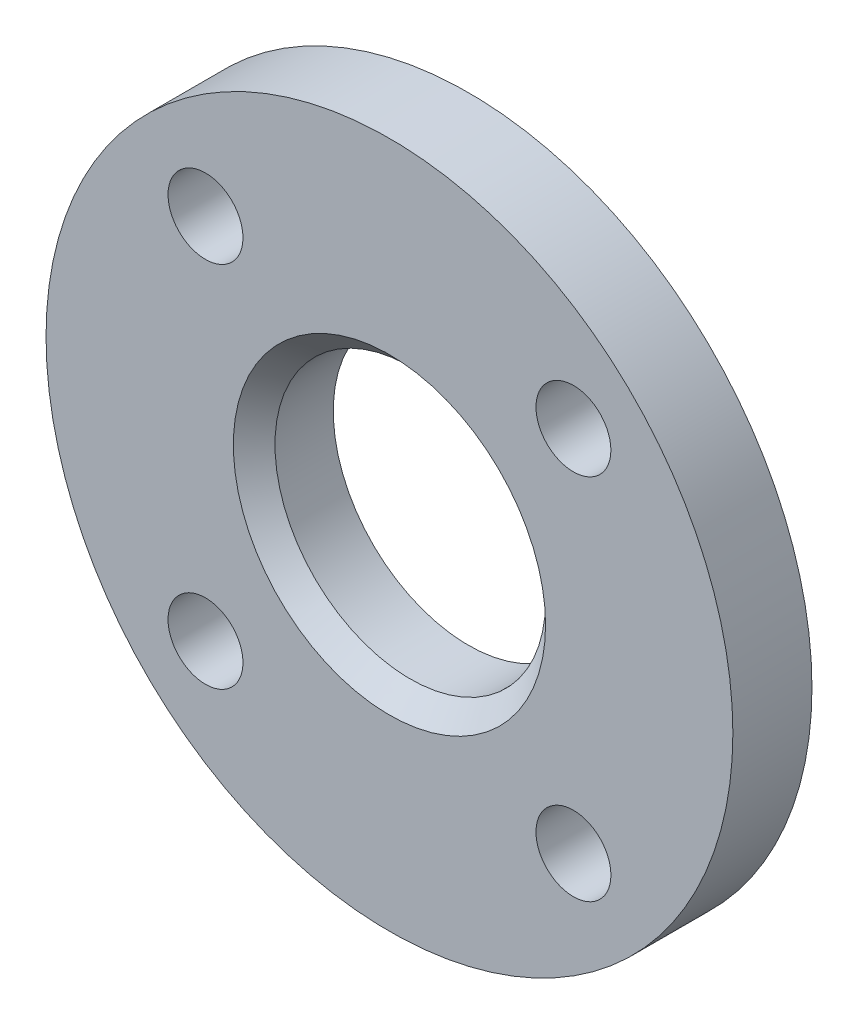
ISO-10303-21;
HEADER;
FILE_DESCRIPTION(('STEP AP214'),'2;1');
FILE_NAME('part.step','',(''),(''),'','','');
FILE_SCHEMA(('AUTOMOTIVE_DESIGN { 1 0 10303 214 1 1 1 1 }'));
ENDSEC;
DATA;
#1=APPLICATION_CONTEXT('core data for automotive mechanical design processes');
#2=APPLICATION_PROTOCOL_DEFINITION('international standard','automotive_design',2000,#1);
#3=PRODUCT_CONTEXT('',#1,'mechanical');
#4=PRODUCT('Part','Part','',(#3));
#5=PRODUCT_RELATED_PRODUCT_CATEGORY('part','',(#4));
#6=PRODUCT_DEFINITION_FORMATION('','',#4);
#7=PRODUCT_DEFINITION_CONTEXT('part definition',#1,'design');
#8=PRODUCT_DEFINITION('design','',#6,#7);
#9=PRODUCT_DEFINITION_SHAPE('','',#8);
#10=(LENGTH_UNIT() NAMED_UNIT(*) SI_UNIT(.MILLI.,.METRE.));
#11=(NAMED_UNIT(*) PLANE_ANGLE_UNIT() SI_UNIT($,.RADIAN.));
#12=(NAMED_UNIT(*) SI_UNIT($,.STERADIAN.) SOLID_ANGLE_UNIT());
#13=UNCERTAINTY_MEASURE_WITH_UNIT(LENGTH_MEASURE(1.E-05),#10,'distance_accuracy_value','');
#14=(GEOMETRIC_REPRESENTATION_CONTEXT(3) GLOBAL_UNCERTAINTY_ASSIGNED_CONTEXT((#13)) GLOBAL_UNIT_ASSIGNED_CONTEXT((#10,
#11,#12)) REPRESENTATION_CONTEXT('',''));
#15=CARTESIAN_POINT('',(0.,0.,0.));
#16=DIRECTION('',(0.,0.,1.));
#17=DIRECTION('',(1.,0.,0.));
#18=AXIS2_PLACEMENT_3D('',#15,#16,#17);
#19=CARTESIAN_POINT('',(0.,0.,19.));
#20=DIRECTION('',(0.,0.,1.));
#21=DIRECTION('',(1.,0.,0.));
#22=AXIS2_PLACEMENT_3D('',#19,#20,#21);
#23=PLANE('',#22);
#24=CARTESIAN_POINT('',(-44.194173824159,44.1941738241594,19.));
#25=DIRECTION('',(0.,0.,1.));
#26=DIRECTION('',(0.,1.,0.));
#27=AXIS2_PLACEMENT_3D('',#24,#25,#26);
#28=CIRCLE('',#27,9.00000000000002);
#29=CARTESIAN_POINT('',(-44.1941738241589,53.1941738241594,19.));
#30=VERTEX_POINT('',#29);
#31=EDGE_CURVE('E76',#30,#30,#28,.T.);
#32=ORIENTED_EDGE('',*,*,#31,.F.);
#33=EDGE_LOOP('',(#32));
#34=FACE_BOUND('',#33,.T.);
#35=CARTESIAN_POINT('',(-44.1941738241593,-44.1941738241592,19.));
#36=DIRECTION('',(0.,0.,1.));
#37=DIRECTION('',(-1.,0.,0.));
#38=AXIS2_PLACEMENT_3D('',#35,#36,#37);
#39=CIRCLE('',#38,9.00000000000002);
#40=CARTESIAN_POINT('',(-53.1941738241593,-44.1941738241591,19.));
#41=VERTEX_POINT('',#40);
#42=EDGE_CURVE('E70',#41,#41,#39,.T.);
#43=ORIENTED_EDGE('',*,*,#42,.F.);
#44=EDGE_LOOP('',(#43));
#45=FACE_BOUND('',#44,.T.);
#46=CARTESIAN_POINT('',(44.1941738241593,-44.1941738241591,19.));
#47=DIRECTION('',(0.,0.,1.));
#48=DIRECTION('',(0.,-1.,0.));
#49=AXIS2_PLACEMENT_3D('',#46,#47,#48);
#50=CIRCLE('',#49,9.00000000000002);
#51=CARTESIAN_POINT('',(44.1941738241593,-53.1941738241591,19.));
#52=VERTEX_POINT('',#51);
#53=EDGE_CURVE('E64',#52,#52,#50,.T.);
#54=ORIENTED_EDGE('',*,*,#53,.F.);
#55=EDGE_LOOP('',(#54));
#56=FACE_BOUND('',#55,.T.);
#57=CARTESIAN_POINT('',(44.194173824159,44.1941738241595,19.));
#58=DIRECTION('',(0.,0.,1.));
#59=DIRECTION('',(1.,0.,0.));
#60=AXIS2_PLACEMENT_3D('',#57,#58,#59);
#61=CIRCLE('',#60,9.00000000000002);
#62=CARTESIAN_POINT('',(53.194173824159,44.1941738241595,19.));
#63=VERTEX_POINT('',#62);
#64=EDGE_CURVE('E58',#63,#63,#61,.T.);
#65=ORIENTED_EDGE('',*,*,#64,.F.);
#66=EDGE_LOOP('',(#65));
#67=FACE_BOUND('',#66,.T.);
#68=CARTESIAN_POINT('',(0.,0.,19.));
#69=DIRECTION('',(0.,0.,1.));
#70=DIRECTION('',(1.,0.,0.));
#71=AXIS2_PLACEMENT_3D('',#68,#69,#70);
#72=CIRCLE('',#71,37.5000000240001);
#73=CARTESIAN_POINT('',(37.5000000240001,0.,19.));
#74=VERTEX_POINT('',#73);
#75=EDGE_CURVE('E10',#74,#74,#72,.F.);
#76=ORIENTED_EDGE('',*,*,#75,.T.);
#77=EDGE_LOOP('',(#76));
#78=FACE_BOUND('',#77,.T.);
#79=CARTESIAN_POINT('',(0.,0.,19.));
#80=DIRECTION('',(0.,0.,1.));
#81=DIRECTION('',(1.,0.,0.));
#82=AXIS2_PLACEMENT_3D('',#79,#80,#81);
#83=CIRCLE('',#82,82.5);
#84=CARTESIAN_POINT('',(82.5,0.,19.));
#85=VERTEX_POINT('',#84);
#86=EDGE_CURVE('E45',#85,#85,#83,.T.);
#87=ORIENTED_EDGE('',*,*,#86,.T.);
#88=EDGE_LOOP('',(#87));
#89=FACE_BOUND('',#88,.T.);
#90=ADVANCED_FACE('F34',(#34,#45,#56,#67,#78,#89),#23,.T.);
#91=CARTESIAN_POINT('',(0.,0.,0.));
#92=DIRECTION('',(0.,0.,1.));
#93=DIRECTION('',(1.,0.,0.));
#94=AXIS2_PLACEMENT_3D('',#91,#92,#93);
#95=PLANE('',#94);
#96=CARTESIAN_POINT('',(-44.194173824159,44.1941738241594,0.));
#97=DIRECTION('',(0.,0.,1.));
#98=DIRECTION('',(0.,1.,0.));
#99=AXIS2_PLACEMENT_3D('',#96,#97,#98);
#100=CIRCLE('',#99,9.00000000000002);
#101=CARTESIAN_POINT('',(-44.1941738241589,53.1941738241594,0.));
#102=VERTEX_POINT('',#101);
#103=EDGE_CURVE('E73',#102,#102,#100,.T.);
#104=ORIENTED_EDGE('',*,*,#103,.T.);
#105=EDGE_LOOP('',(#104));
#106=FACE_BOUND('',#105,.T.);
#107=CARTESIAN_POINT('',(-44.1941738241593,-44.1941738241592,0.));
#108=DIRECTION('',(0.,0.,1.));
#109=DIRECTION('',(-1.,0.,0.));
#110=AXIS2_PLACEMENT_3D('',#107,#108,#109);
#111=CIRCLE('',#110,9.00000000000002);
#112=CARTESIAN_POINT('',(-53.1941738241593,-44.1941738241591,0.));
#113=VERTEX_POINT('',#112);
#114=EDGE_CURVE('E67',#113,#113,#111,.T.);
#115=ORIENTED_EDGE('',*,*,#114,.T.);
#116=EDGE_LOOP('',(#115));
#117=FACE_BOUND('',#116,.T.);
#118=CARTESIAN_POINT('',(44.1941738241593,-44.1941738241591,0.));
#119=DIRECTION('',(0.,0.,1.));
#120=DIRECTION('',(0.,-1.,0.));
#121=AXIS2_PLACEMENT_3D('',#118,#119,#120);
#122=CIRCLE('',#121,9.00000000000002);
#123=CARTESIAN_POINT('',(44.1941738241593,-53.1941738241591,0.));
#124=VERTEX_POINT('',#123);
#125=EDGE_CURVE('E61',#124,#124,#122,.T.);
#126=ORIENTED_EDGE('',*,*,#125,.T.);
#127=EDGE_LOOP('',(#126));
#128=FACE_BOUND('',#127,.T.);
#129=CARTESIAN_POINT('',(44.194173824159,44.1941738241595,0.));
#130=DIRECTION('',(0.,0.,1.));
#131=DIRECTION('',(1.,0.,0.));
#132=AXIS2_PLACEMENT_3D('',#129,#130,#131);
#133=CIRCLE('',#132,9.00000000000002);
#134=CARTESIAN_POINT('',(53.194173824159,44.1941738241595,0.));
#135=VERTEX_POINT('',#134);
#136=EDGE_CURVE('E57',#135,#135,#133,.T.);
#137=ORIENTED_EDGE('',*,*,#136,.T.);
#138=EDGE_LOOP('',(#137));
#139=FACE_BOUND('',#138,.T.);
#140=CARTESIAN_POINT('',(0.,0.,0.));
#141=DIRECTION('',(0.,0.,1.));
#142=DIRECTION('',(1.,0.,0.));
#143=AXIS2_PLACEMENT_3D('',#140,#141,#142);
#144=CIRCLE('',#143,82.5);
#145=CARTESIAN_POINT('',(82.5,0.,0.));
#146=VERTEX_POINT('',#145);
#147=EDGE_CURVE('E49',#146,#146,#144,.T.);
#148=ORIENTED_EDGE('',*,*,#147,.F.);
#149=EDGE_LOOP('',(#148));
#150=FACE_BOUND('',#149,.T.);
#151=CARTESIAN_POINT('',(0.,0.,0.));
#152=DIRECTION('',(0.,0.,1.));
#153=DIRECTION('',(1.,0.,0.));
#154=AXIS2_PLACEMENT_3D('',#151,#152,#153);
#155=CIRCLE('',#154,32.500000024);
#156=CARTESIAN_POINT('',(32.500000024,0.,0.));
#157=VERTEX_POINT('',#156);
#158=EDGE_CURVE('E53',#157,#157,#155,.T.);
#159=ORIENTED_EDGE('',*,*,#158,.T.);
#160=EDGE_LOOP('',(#159));
#161=FACE_BOUND('',#160,.T.);
#162=ADVANCED_FACE('F82',(#106,#117,#128,#139,#150,#161),#95,.F.);
#163=CARTESIAN_POINT('',(0.,0.,19.));
#164=DIRECTION('',(0.,0.,-1.));
#165=DIRECTION('',(-1.,0.,0.));
#166=AXIS2_PLACEMENT_3D('',#163,#164,#165);
#167=CYLINDRICAL_SURFACE('',#166,82.5);
#168=ORIENTED_EDGE('',*,*,#86,.F.);
#169=EDGE_LOOP('',(#168));
#170=FACE_BOUND('',#169,.T.);
#171=ORIENTED_EDGE('',*,*,#147,.T.);
#172=EDGE_LOOP('',(#171));
#173=FACE_BOUND('',#172,.T.);
#174=ADVANCED_FACE('F103',(#170,#173),#167,.T.);
#175=CARTESIAN_POINT('',(0.,0.,19.));
#176=DIRECTION('',(0.,0.,-1.));
#177=DIRECTION('',(-1.,0.,0.));
#178=AXIS2_PLACEMENT_3D('',#175,#176,#177);
#179=CYLINDRICAL_SURFACE('',#178,32.500000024);
#180=CARTESIAN_POINT('',(0.,0.,13.9999999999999));
#181=DIRECTION('',(0.,0.,1.));
#182=DIRECTION('',(1.,0.,0.));
#183=AXIS2_PLACEMENT_3D('',#180,#181,#182);
#184=CIRCLE('',#183,32.500000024);
#185=CARTESIAN_POINT('',(32.500000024,0.,13.9999999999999));
#186=VERTEX_POINT('',#185);
#187=EDGE_CURVE('E41',#186,#186,#184,.T.);
#188=ORIENTED_EDGE('',*,*,#187,.T.);
#189=EDGE_LOOP('',(#188));
#190=FACE_BOUND('',#189,.T.);
#191=ORIENTED_EDGE('',*,*,#158,.F.);
#192=EDGE_LOOP('',(#191));
#193=FACE_BOUND('',#192,.T.);
#194=ADVANCED_FACE('F106',(#190,#193),#179,.F.);
#195=CARTESIAN_POINT('',(0.,0.,13.9999999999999));
#196=DIRECTION('',(0.,0.,1.));
#197=DIRECTION('',(1.,0.,0.));
#198=AXIS2_PLACEMENT_3D('',#195,#196,#197);
#199=CONICAL_SURFACE('',#198,32.500000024,0.785398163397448);
#200=ORIENTED_EDGE('',*,*,#75,.F.);
#201=EDGE_LOOP('',(#200));
#202=FACE_BOUND('',#201,.T.);
#203=ORIENTED_EDGE('',*,*,#187,.F.);
#204=EDGE_LOOP('',(#203));
#205=FACE_BOUND('',#204,.T.);
#206=ADVANCED_FACE('F36',(#202,#205),#199,.F.);
#207=CARTESIAN_POINT('',(44.194173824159,44.1941738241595,0.));
#208=DIRECTION('',(0.,0.,1.));
#209=DIRECTION('',(1.,0.,0.));
#210=AXIS2_PLACEMENT_3D('',#207,#208,#209);
#211=CYLINDRICAL_SURFACE('',#210,9.00000000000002);
#212=ORIENTED_EDGE('',*,*,#136,.F.);
#213=EDGE_LOOP('',(#212));
#214=FACE_BOUND('',#213,.T.);
#215=ORIENTED_EDGE('',*,*,#64,.T.);
#216=EDGE_LOOP('',(#215));
#217=FACE_BOUND('',#216,.T.);
#218=ADVANCED_FACE('F119',(#214,#217),#211,.F.);
#219=CARTESIAN_POINT('',(44.1941738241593,-44.1941738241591,0.));
#220=DIRECTION('',(0.,0.,1.));
#221=DIRECTION('',(1.,0.,0.));
#222=AXIS2_PLACEMENT_3D('',#219,#220,#221);
#223=CYLINDRICAL_SURFACE('',#222,9.00000000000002);
#224=ORIENTED_EDGE('',*,*,#125,.F.);
#225=EDGE_LOOP('',(#224));
#226=FACE_BOUND('',#225,.T.);
#227=ORIENTED_EDGE('',*,*,#53,.T.);
#228=EDGE_LOOP('',(#227));
#229=FACE_BOUND('',#228,.T.);
#230=ADVANCED_FACE('F124',(#226,#229),#223,.F.);
#231=CARTESIAN_POINT('',(-44.1941738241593,-44.1941738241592,0.));
#232=DIRECTION('',(0.,0.,1.));
#233=DIRECTION('',(1.,0.,0.));
#234=AXIS2_PLACEMENT_3D('',#231,#232,#233);
#235=CYLINDRICAL_SURFACE('',#234,9.00000000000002);
#236=ORIENTED_EDGE('',*,*,#114,.F.);
#237=EDGE_LOOP('',(#236));
#238=FACE_BOUND('',#237,.T.);
#239=ORIENTED_EDGE('',*,*,#42,.T.);
#240=EDGE_LOOP('',(#239));
#241=FACE_BOUND('',#240,.T.);
#242=ADVANCED_FACE('F88',(#238,#241),#235,.F.);
#243=CARTESIAN_POINT('',(-44.194173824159,44.1941738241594,0.));
#244=DIRECTION('',(0.,0.,1.));
#245=DIRECTION('',(1.,0.,0.));
#246=AXIS2_PLACEMENT_3D('',#243,#244,#245);
#247=CYLINDRICAL_SURFACE('',#246,9.00000000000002);
#248=ORIENTED_EDGE('',*,*,#103,.F.);
#249=EDGE_LOOP('',(#248));
#250=FACE_BOUND('',#249,.T.);
#251=ORIENTED_EDGE('',*,*,#31,.T.);
#252=EDGE_LOOP('',(#251));
#253=FACE_BOUND('',#252,.T.);
#254=ADVANCED_FACE('F85',(#250,#253),#247,.F.);
#255=CLOSED_SHELL('',(#90,#162,#174,#194,#206,#218,#230,#242,#254));
#256=MANIFOLD_SOLID_BREP('B2',#255);
#257=ADVANCED_BREP_SHAPE_REPRESENTATION('',(#18,#256),#14);
#258=SHAPE_DEFINITION_REPRESENTATION(#9,#257);
ENDSEC;
END-ISO-10303-21;
